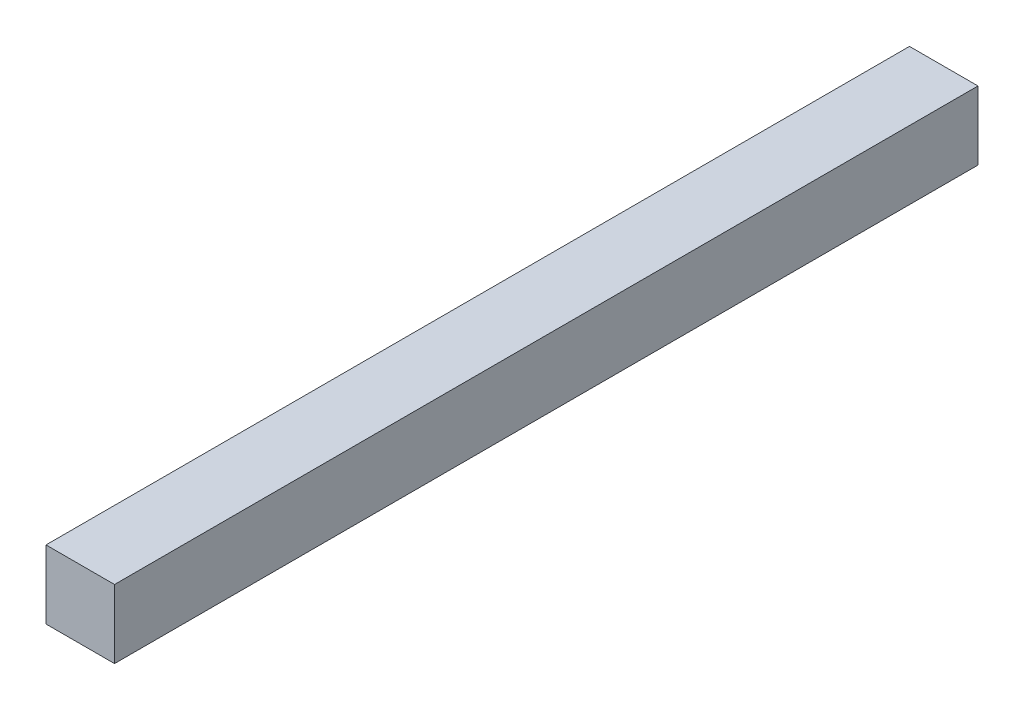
ISO-10303-21;
HEADER;
FILE_DESCRIPTION(('STEP AP214'),'2;1');
FILE_NAME('part.step','',(''),(''),'','','');
FILE_SCHEMA(('AUTOMOTIVE_DESIGN { 1 0 10303 214 1 1 1 1 }'));
ENDSEC;
DATA;
#1=APPLICATION_CONTEXT('core data for automotive mechanical design processes');
#2=APPLICATION_PROTOCOL_DEFINITION('international standard','automotive_design',2000,#1);
#3=PRODUCT_CONTEXT('',#1,'mechanical');
#4=PRODUCT('Part','Part','',(#3));
#5=PRODUCT_RELATED_PRODUCT_CATEGORY('part','',(#4));
#6=PRODUCT_DEFINITION_FORMATION('','',#4);
#7=PRODUCT_DEFINITION_CONTEXT('part definition',#1,'design');
#8=PRODUCT_DEFINITION('design','',#6,#7);
#9=PRODUCT_DEFINITION_SHAPE('','',#8);
#10=(LENGTH_UNIT() NAMED_UNIT(*) SI_UNIT(.MILLI.,.METRE.));
#11=(NAMED_UNIT(*) PLANE_ANGLE_UNIT() SI_UNIT($,.RADIAN.));
#12=(NAMED_UNIT(*) SI_UNIT($,.STERADIAN.) SOLID_ANGLE_UNIT());
#13=UNCERTAINTY_MEASURE_WITH_UNIT(LENGTH_MEASURE(1.E-05),#10,'distance_accuracy_value','');
#14=(GEOMETRIC_REPRESENTATION_CONTEXT(3) GLOBAL_UNCERTAINTY_ASSIGNED_CONTEXT((#13)) GLOBAL_UNIT_ASSIGNED_CONTEXT((#10,
#11,#12)) REPRESENTATION_CONTEXT('',''));
#15=CARTESIAN_POINT('',(0.,0.,0.));
#16=DIRECTION('',(0.,0.,1.));
#17=DIRECTION('',(1.,0.,0.));
#18=AXIS2_PLACEMENT_3D('',#15,#16,#17);
#19=CARTESIAN_POINT('',(0.,0.,80.01));
#20=DIRECTION('',(1.,0.,0.));
#21=DIRECTION('',(0.,1.,0.));
#22=AXIS2_PLACEMENT_3D('',#19,#20,#21);
#23=PLANE('',#22);
#24=DIRECTION('',(0.,-1.,0.));
#25=VECTOR('',#24,1.);
#26=CARTESIAN_POINT('',(0.,0.,0.));
#27=LINE('',#26,#25);
#28=CARTESIAN_POINT('',(0.,0.,0.));
#29=VERTEX_POINT('',#28);
#30=CARTESIAN_POINT('',(0.,-6.35,0.));
#31=VERTEX_POINT('',#30);
#32=EDGE_CURVE('E75',#29,#31,#27,.T.);
#33=ORIENTED_EDGE('',*,*,#32,.T.);
#34=DIRECTION('',(0.,0.,-1.));
#35=VECTOR('',#34,1.);
#36=CARTESIAN_POINT('',(0.,-6.35,80.01));
#37=LINE('',#36,#35);
#38=CARTESIAN_POINT('',(0.,-6.35,80.01));
#39=VERTEX_POINT('',#38);
#40=EDGE_CURVE('E11',#39,#31,#37,.T.);
#41=ORIENTED_EDGE('',*,*,#40,.F.);
#42=DIRECTION('',(0.,-1.,0.));
#43=VECTOR('',#42,1.);
#44=CARTESIAN_POINT('',(0.,0.,80.01));
#45=LINE('',#44,#43);
#46=CARTESIAN_POINT('',(0.,0.,80.01));
#47=VERTEX_POINT('',#46);
#48=EDGE_CURVE('E93',#47,#39,#45,.T.);
#49=ORIENTED_EDGE('',*,*,#48,.F.);
#50=DIRECTION('',(0.,0.,-1.));
#51=VECTOR('',#50,1.);
#52=CARTESIAN_POINT('',(0.,0.,80.01));
#53=LINE('',#52,#51);
#54=EDGE_CURVE('E87',#47,#29,#53,.T.);
#55=ORIENTED_EDGE('',*,*,#54,.T.);
#56=EDGE_LOOP('',(#33,#41,#49,#55));
#57=FACE_BOUND('',#56,.T.);
#58=ADVANCED_FACE('F31',(#57),#23,.F.);
#59=CARTESIAN_POINT('',(0.,-6.35,80.01));
#60=DIRECTION('',(0.,1.,0.));
#61=DIRECTION('',(0.,0.,1.));
#62=AXIS2_PLACEMENT_3D('',#59,#60,#61);
#63=PLANE('',#62);
#64=DIRECTION('',(1.,0.,0.));
#65=VECTOR('',#64,1.);
#66=CARTESIAN_POINT('',(0.,-6.35,0.));
#67=LINE('',#66,#65);
#68=CARTESIAN_POINT('',(6.35,-6.35,0.));
#69=VERTEX_POINT('',#68);
#70=EDGE_CURVE('E71',#31,#69,#67,.T.);
#71=ORIENTED_EDGE('',*,*,#70,.T.);
#72=DIRECTION('',(0.,0.,-1.));
#73=VECTOR('',#72,1.);
#74=CARTESIAN_POINT('',(6.35,-6.35,80.01));
#75=LINE('',#74,#73);
#76=CARTESIAN_POINT('',(6.35,-6.35,80.01));
#77=VERTEX_POINT('',#76);
#78=EDGE_CURVE('E38',#77,#69,#75,.T.);
#79=ORIENTED_EDGE('',*,*,#78,.F.);
#80=DIRECTION('',(1.,0.,0.));
#81=VECTOR('',#80,1.);
#82=CARTESIAN_POINT('',(0.,-6.35,80.01));
#83=LINE('',#82,#81);
#84=EDGE_CURVE('E83',#39,#77,#83,.T.);
#85=ORIENTED_EDGE('',*,*,#84,.F.);
#86=ORIENTED_EDGE('',*,*,#40,.T.);
#87=EDGE_LOOP('',(#71,#79,#85,#86));
#88=FACE_BOUND('',#87,.T.);
#89=ADVANCED_FACE('F82',(#88),#63,.F.);
#90=CARTESIAN_POINT('',(6.35,0.,80.01));
#91=DIRECTION('',(-1.,0.,0.));
#92=DIRECTION('',(0.,0.,1.));
#93=AXIS2_PLACEMENT_3D('',#90,#91,#92);
#94=PLANE('',#93);
#95=DIRECTION('',(0.,1.,0.));
#96=VECTOR('',#95,1.);
#97=CARTESIAN_POINT('',(6.35,0.,0.));
#98=LINE('',#97,#96);
#99=CARTESIAN_POINT('',(6.35,0.,0.));
#100=VERTEX_POINT('',#99);
#101=EDGE_CURVE('E76',#69,#100,#98,.T.);
#102=ORIENTED_EDGE('',*,*,#101,.T.);
#103=DIRECTION('',(0.,0.,-1.));
#104=VECTOR('',#103,1.);
#105=CARTESIAN_POINT('',(6.35,0.,80.01));
#106=LINE('',#105,#104);
#107=CARTESIAN_POINT('',(6.35,0.,80.01));
#108=VERTEX_POINT('',#107);
#109=EDGE_CURVE('E99',#108,#100,#106,.T.);
#110=ORIENTED_EDGE('',*,*,#109,.F.);
#111=DIRECTION('',(0.,1.,0.));
#112=VECTOR('',#111,1.);
#113=CARTESIAN_POINT('',(6.35,0.,80.01));
#114=LINE('',#113,#112);
#115=EDGE_CURVE('E50',#77,#108,#114,.T.);
#116=ORIENTED_EDGE('',*,*,#115,.F.);
#117=ORIENTED_EDGE('',*,*,#78,.T.);
#118=EDGE_LOOP('',(#102,#110,#116,#117));
#119=FACE_BOUND('',#118,.T.);
#120=ADVANCED_FACE('F102',(#119),#94,.F.);
#121=CARTESIAN_POINT('',(0.,0.,80.01));
#122=DIRECTION('',(0.,-1.,0.));
#123=DIRECTION('',(0.,0.,-1.));
#124=AXIS2_PLACEMENT_3D('',#121,#122,#123);
#125=PLANE('',#124);
#126=DIRECTION('',(-1.,0.,0.));
#127=VECTOR('',#126,1.);
#128=CARTESIAN_POINT('',(0.,0.,0.));
#129=LINE('',#128,#127);
#130=EDGE_CURVE('E91',#100,#29,#129,.T.);
#131=ORIENTED_EDGE('',*,*,#130,.T.);
#132=ORIENTED_EDGE('',*,*,#54,.F.);
#133=DIRECTION('',(-1.,0.,0.));
#134=VECTOR('',#133,1.);
#135=CARTESIAN_POINT('',(0.,0.,80.01));
#136=LINE('',#135,#134);
#137=EDGE_CURVE('E45',#108,#47,#136,.T.);
#138=ORIENTED_EDGE('',*,*,#137,.F.);
#139=ORIENTED_EDGE('',*,*,#109,.T.);
#140=EDGE_LOOP('',(#131,#132,#138,#139));
#141=FACE_BOUND('',#140,.T.);
#142=ADVANCED_FACE('F104',(#141),#125,.F.);
#143=CARTESIAN_POINT('',(0.,-6.35,80.01));
#144=DIRECTION('',(0.,0.,1.));
#145=DIRECTION('',(1.,0.,0.));
#146=AXIS2_PLACEMENT_3D('',#143,#144,#145);
#147=PLANE('',#146);
#148=ORIENTED_EDGE('',*,*,#48,.T.);
#149=ORIENTED_EDGE('',*,*,#84,.T.);
#150=ORIENTED_EDGE('',*,*,#115,.T.);
#151=ORIENTED_EDGE('',*,*,#137,.T.);
#152=EDGE_LOOP('',(#148,#149,#150,#151));
#153=FACE_BOUND('',#152,.T.);
#154=ADVANCED_FACE('F105',(#153),#147,.T.);
#155=CARTESIAN_POINT('',(0.,-6.35,0.));
#156=DIRECTION('',(0.,0.,1.));
#157=DIRECTION('',(1.,0.,0.));
#158=AXIS2_PLACEMENT_3D('',#155,#156,#157);
#159=PLANE('',#158);
#160=ORIENTED_EDGE('',*,*,#32,.F.);
#161=ORIENTED_EDGE('',*,*,#130,.F.);
#162=ORIENTED_EDGE('',*,*,#101,.F.);
#163=ORIENTED_EDGE('',*,*,#70,.F.);
#164=EDGE_LOOP('',(#160,#161,#162,#163));
#165=FACE_BOUND('',#164,.T.);
#166=ADVANCED_FACE('F72',(#165),#159,.F.);
#167=CLOSED_SHELL('',(#58,#89,#120,#142,#154,#166));
#168=MANIFOLD_SOLID_BREP('B2',#167);
#169=ADVANCED_BREP_SHAPE_REPRESENTATION('',(#18,#168),#14);
#170=SHAPE_DEFINITION_REPRESENTATION(#9,#169);
ENDSEC;
END-ISO-10303-21;
